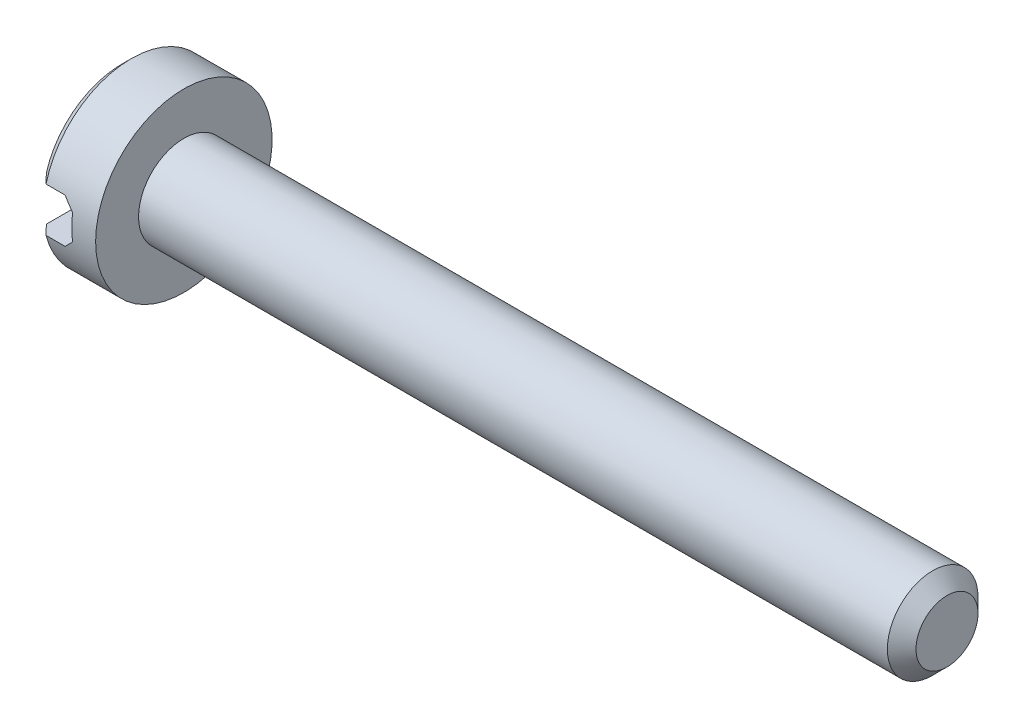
ISO-10303-21;
HEADER;
FILE_DESCRIPTION(('STEP AP214'),'2;1');
FILE_NAME('part.step','',(''),(''),'','','');
FILE_SCHEMA(('AUTOMOTIVE_DESIGN { 1 0 10303 214 1 1 1 1 }'));
ENDSEC;
DATA;
#1=APPLICATION_CONTEXT('core data for automotive mechanical design processes');
#2=APPLICATION_PROTOCOL_DEFINITION('international standard','automotive_design',2000,#1);
#3=PRODUCT_CONTEXT('',#1,'mechanical');
#4=PRODUCT('Part','Part','',(#3));
#5=PRODUCT_RELATED_PRODUCT_CATEGORY('part','',(#4));
#6=PRODUCT_DEFINITION_FORMATION('','',#4);
#7=PRODUCT_DEFINITION_CONTEXT('part definition',#1,'design');
#8=PRODUCT_DEFINITION('design','',#6,#7);
#9=PRODUCT_DEFINITION_SHAPE('','',#8);
#10=(LENGTH_UNIT() NAMED_UNIT(*) SI_UNIT(.MILLI.,.METRE.));
#11=(NAMED_UNIT(*) PLANE_ANGLE_UNIT() SI_UNIT($,.RADIAN.));
#12=(NAMED_UNIT(*) SI_UNIT($,.STERADIAN.) SOLID_ANGLE_UNIT());
#13=UNCERTAINTY_MEASURE_WITH_UNIT(LENGTH_MEASURE(1.E-05),#10,'distance_accuracy_value','');
#14=(GEOMETRIC_REPRESENTATION_CONTEXT(3) GLOBAL_UNCERTAINTY_ASSIGNED_CONTEXT((#13)) GLOBAL_UNIT_ASSIGNED_CONTEXT((#10,
#11,#12)) REPRESENTATION_CONTEXT('',''));
#15=CARTESIAN_POINT('',(0.,0.,0.));
#16=DIRECTION('',(0.,0.,1.));
#17=DIRECTION('',(1.,0.,0.));
#18=AXIS2_PLACEMENT_3D('',#15,#16,#17);
#19=CARTESIAN_POINT('',(1.3,1.85,0.));
#20=DIRECTION('',(-1.,0.,0.));
#21=DIRECTION('',(0.,0.,1.));
#22=AXIS2_PLACEMENT_3D('',#19,#20,#21);
#23=PLANE('',#22);
#24=CARTESIAN_POINT('',(1.3,0.,0.));
#25=DIRECTION('',(-1.,0.,0.));
#26=DIRECTION('',(0.,0.,1.));
#27=AXIS2_PLACEMENT_3D('',#24,#25,#26);
#28=CIRCLE('',#27,1.85);
#29=CARTESIAN_POINT('',(1.3,0.,1.85));
#30=VERTEX_POINT('',#29);
#31=EDGE_CURVE('E111',#30,#30,#28,.T.);
#32=ORIENTED_EDGE('',*,*,#31,.F.);
#33=EDGE_LOOP('',(#32));
#34=FACE_BOUND('',#33,.T.);
#35=CARTESIAN_POINT('',(1.3,0.,0.));
#36=DIRECTION('',(-1.,0.,0.));
#37=DIRECTION('',(0.,0.,1.));
#38=AXIS2_PLACEMENT_3D('',#35,#36,#37);
#39=CIRCLE('',#38,0.95);
#40=CARTESIAN_POINT('',(1.3,0.,0.95));
#41=VERTEX_POINT('',#40);
#42=EDGE_CURVE('E150',#41,#41,#39,.F.);
#43=ORIENTED_EDGE('',*,*,#42,.F.);
#44=EDGE_LOOP('',(#43));
#45=FACE_BOUND('',#44,.T.);
#46=ADVANCED_FACE('F37',(#34,#45),#23,.F.);
#47=CARTESIAN_POINT('',(0.2,0.,0.));
#48=DIRECTION('',(1.,0.,0.));
#49=DIRECTION('',(0.,0.,-1.));
#50=AXIS2_PLACEMENT_3D('',#47,#48,#49);
#51=CONICAL_SURFACE('',#50,1.85,0.785398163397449);
#52=CARTESIAN_POINT('',(0.2,0.,0.));
#53=DIRECTION('',(-1.,0.,0.));
#54=DIRECTION('',(0.,0.,1.));
#55=AXIS2_PLACEMENT_3D('',#52,#53,#54);
#56=CIRCLE('',#55,1.85);
#57=CARTESIAN_POINT('',(0.2,0.465549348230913,1.79046468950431));
#58=VERTEX_POINT('',#57);
#59=CARTESIAN_POINT('',(0.2,0.465549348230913,-1.79046468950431));
#60=VERTEX_POINT('',#59);
#61=EDGE_CURVE('E132',#58,#60,#56,.T.);
#62=ORIENTED_EDGE('',*,*,#61,.T.);
#63=CARTESIAN_POINT('',(2.42344087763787,0.465549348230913,-4.04674985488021));
#64=CARTESIAN_POINT('',(2.31422073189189,0.465549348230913,-3.9368070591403));
#65=CARTESIAN_POINT('',(2.20502763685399,0.465549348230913,-3.82683737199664));
#66=CARTESIAN_POINT('',(1.98669704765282,0.465549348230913,-3.60680197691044));
#67=CARTESIAN_POINT('',(1.87755956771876,0.465549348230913,-3.49673625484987));
#68=CARTESIAN_POINT('',(1.65894933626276,0.465549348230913,-3.27607034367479));
#69=CARTESIAN_POINT('',(1.54947697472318,0.465549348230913,-3.16546976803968));
#70=CARTESIAN_POINT('',(1.33068893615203,0.465549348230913,-2.94415427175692));
#71=CARTESIAN_POINT('',(1.22137323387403,0.465549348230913,-2.83343937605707));
#72=CARTESIAN_POINT('',(0.94158553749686,0.465549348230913,-2.54959909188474));
#73=CARTESIAN_POINT('',(0.771245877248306,0.465549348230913,-2.37634297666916));
#74=CARTESIAN_POINT('',(0.516315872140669,0.465549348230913,-2.11577452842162));
#75=CARTESIAN_POINT('',(0.431406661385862,0.465549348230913,-2.02877427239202));
#76=CARTESIAN_POINT('',(0.261908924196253,0.465549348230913,-1.85447495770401));
#77=CARTESIAN_POINT('',(0.177320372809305,0.465549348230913,-1.76717592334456));
#78=CARTESIAN_POINT('',(0.00893926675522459,0.465549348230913,-1.59244630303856));
#79=CARTESIAN_POINT('',(-0.0748550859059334,0.465549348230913,-1.50501745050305));
#80=CARTESIAN_POINT('',(-0.241707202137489,0.465549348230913,-1.32940591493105));
#81=CARTESIAN_POINT('',(-0.324764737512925,0.465549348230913,-1.24122301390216));
#82=CARTESIAN_POINT('',(-0.448249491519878,0.465549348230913,-1.10803308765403));
#83=CARTESIAN_POINT('',(-0.4892012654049,0.465549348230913,-1.06351303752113));
#84=CARTESIAN_POINT('',(-0.570603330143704,0.465549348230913,-0.974017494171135));
#85=CARTESIAN_POINT('',(-0.61105363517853,0.465549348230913,-0.929042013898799));
#86=CARTESIAN_POINT('',(-0.691196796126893,0.465549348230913,-0.838458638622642));
#87=CARTESIAN_POINT('',(-0.730890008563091,0.465549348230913,-0.792851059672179));
#88=CARTESIAN_POINT('',(-0.809128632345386,0.465549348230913,-0.700664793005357));
#89=CARTESIAN_POINT('',(-0.847674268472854,0.465549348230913,-0.654086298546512));
#90=CARTESIAN_POINT('',(-0.899367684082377,0.465549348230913,-0.588920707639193));
#91=CARTESIAN_POINT('',(-0.913355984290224,0.465549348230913,-0.571002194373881));
#92=CARTESIAN_POINT('',(-0.940978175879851,0.465549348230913,-0.53489334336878));
#93=CARTESIAN_POINT('',(-0.954612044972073,0.465549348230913,-0.516702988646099));
#94=CARTESIAN_POINT('',(-0.994922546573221,0.465549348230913,-0.461548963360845));
#95=CARTESIAN_POINT('',(-1.02093788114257,0.465549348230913,-0.424089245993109));
#96=CARTESIAN_POINT('',(-1.06919063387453,0.465549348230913,-0.348468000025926));
#97=CARTESIAN_POINT('',(-1.09152270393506,0.465549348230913,-0.310367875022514));
#98=CARTESIAN_POINT('',(-1.13109948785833,0.465549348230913,-0.231663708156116));
#99=CARTESIAN_POINT('',(-1.1483700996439,0.465549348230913,-0.191073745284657));
#100=CARTESIAN_POINT('',(-1.16937161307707,0.465549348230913,-0.122137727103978));
#101=CARTESIAN_POINT('',(-1.17573754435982,0.465549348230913,-0.0946292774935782));
#102=CARTESIAN_POINT('',(-1.18362415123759,0.465549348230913,-0.0389959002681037));
#103=CARTESIAN_POINT('',(-1.1851644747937,0.465549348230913,-0.0108739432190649));
#104=CARTESIAN_POINT('',(-1.18310496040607,0.465549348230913,0.0451823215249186));
#105=CARTESIAN_POINT('',(-1.17950248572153,0.465549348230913,0.0731165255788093));
#106=CARTESIAN_POINT('',(-1.16789735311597,0.465549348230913,0.128135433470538));
#107=CARTESIAN_POINT('',(-1.15987428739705,0.465549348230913,0.155215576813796));
#108=CARTESIAN_POINT('',(-1.13863829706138,0.465549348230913,0.213647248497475));
#109=CARTESIAN_POINT('',(-1.12469509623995,0.465549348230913,0.244723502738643));
#110=CARTESIAN_POINT('',(-1.09383840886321,0.465549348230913,0.305390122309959));
#111=CARTESIAN_POINT('',(-1.07691840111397,0.465549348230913,0.334977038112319));
#112=CARTESIAN_POINT('',(-1.04106417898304,0.465549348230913,0.393185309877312));
#113=CARTESIAN_POINT('',(-1.02211606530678,0.465549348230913,0.421797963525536));
#114=CARTESIAN_POINT('',(-0.982981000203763,0.465549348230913,0.478106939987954));
#115=CARTESIAN_POINT('',(-0.962795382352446,0.465549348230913,0.505804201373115));
#116=CARTESIAN_POINT('',(-0.919274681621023,0.465549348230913,0.563580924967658));
#117=CARTESIAN_POINT('',(-0.895838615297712,0.465549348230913,0.593583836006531));
#118=CARTESIAN_POINT('',(-0.848230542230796,0.465549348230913,0.65300190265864));
#119=CARTESIAN_POINT('',(-0.82405844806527,0.465549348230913,0.682416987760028));
#120=CARTESIAN_POINT('',(-0.750747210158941,0.465549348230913,0.770035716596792));
#121=CARTESIAN_POINT('',(-0.700832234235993,0.465549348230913,0.827588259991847));
#122=CARTESIAN_POINT('',(-0.599780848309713,0.465549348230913,0.941762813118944));
#123=CARTESIAN_POINT('',(-0.548642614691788,0.465549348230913,0.998383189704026));
#124=CARTESIAN_POINT('',(-0.445660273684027,0.465549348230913,1.11095186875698));
#125=CARTESIAN_POINT('',(-0.393816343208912,0.465549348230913,1.16690033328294));
#126=CARTESIAN_POINT('',(-0.289869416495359,0.465549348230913,1.27812634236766));
#127=CARTESIAN_POINT('',(-0.237768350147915,0.465549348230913,1.33340569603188));
#128=CARTESIAN_POINT('',(-0.133235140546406,0.465549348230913,1.44365673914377));
#129=CARTESIAN_POINT('',(-0.0808029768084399,0.465549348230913,1.49862840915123));
#130=CARTESIAN_POINT('',(0.0767523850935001,0.465549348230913,1.66311055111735));
#131=CARTESIAN_POINT('',(0.182225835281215,0.465549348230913,1.77228519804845));
#132=CARTESIAN_POINT('',(0.46430719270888,0.465549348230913,2.06287985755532));
#133=CARTESIAN_POINT('',(0.641375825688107,0.465549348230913,2.24385154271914));
#134=CARTESIAN_POINT('',(0.996250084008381,0.465549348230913,2.60519009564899));
#135=CARTESIAN_POINT('',(1.17405593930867,0.465549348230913,2.7855567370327));
#136=CARTESIAN_POINT('',(1.53035733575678,0.465549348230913,3.14622495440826));
#137=CARTESIAN_POINT('',(1.70885353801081,0.465549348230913,3.32652587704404));
#138=CARTESIAN_POINT('',(2.06602855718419,0.465549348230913,3.68681939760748));
#139=CARTESIAN_POINT('',(2.24470728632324,0.465549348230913,3.86681208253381));
#140=CARTESIAN_POINT('',(2.42344087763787,0.465549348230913,4.04674985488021));
#141=B_SPLINE_CURVE_WITH_KNOTS('',3,(#63,#64,#65,#66,#67,#68,#69,#70,#71,#72,#73,#74,#75,#76,
#77,#78,#79,#80,#81,#82,#83,#84,#85,#86,#87,#88,#89,#90,#91,#92,#93,#94,#95,#96,#97,#98,#99,
#100,#101,#102,#103,#104,#105,#106,#107,#108,#109,#110,#111,#112,#113,#114,#115,#116,#117,#118,
#119,#120,#121,#122,#123,#124,#125,#126,#127,#128,#129,#130,#131,#132,#133,#134,#135,#136,#137,
#138,#139,#140),.UNSPECIFIED.,.F.,.F.,(4,2,2,2,2,2,2,2,2,2,2,2,2,2,2,2,2,2,2,2,2,2,2,2,2,2,2,2,
2,2,2,2,2,2,2,2,2,2,4),(0.,0.46491734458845,0.929921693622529,1.39677290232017,1.86353771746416,
2.59243863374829,2.95714021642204,3.32181281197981,3.68511212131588,4.04852027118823,
4.22998896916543,4.41145252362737,4.59282840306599,4.77416851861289,4.84236041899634,
4.91055659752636,5.04728388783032,5.17961007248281,5.31124686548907,5.39561130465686,
5.47963179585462,5.56369538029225,5.64815033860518,5.75007643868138,5.85222867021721,
5.95513223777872,6.05792679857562,6.17212384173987,6.28633450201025,6.51484917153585,
6.74372884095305,6.97255215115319,7.20043854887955,7.42833918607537,7.88374058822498,
8.64329990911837,9.40311729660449,10.1642502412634,10.9251118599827),.UNSPECIFIED.);
#142=CARTESIAN_POINT('',(0.,0.465549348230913,-1.58296045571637));
#143=VERTEX_POINT('',#142);
#144=EDGE_CURVE('E128',#60,#143,#141,.T.);
#145=ORIENTED_EDGE('',*,*,#144,.T.);
#146=CARTESIAN_POINT('',(0.,0.,0.));
#147=DIRECTION('',(-1.,0.,0.));
#148=DIRECTION('',(0.,0.,1.));
#149=AXIS2_PLACEMENT_3D('',#146,#147,#148);
#150=CIRCLE('',#149,1.65);
#151=CARTESIAN_POINT('',(0.,0.465549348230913,1.58296045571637));
#152=VERTEX_POINT('',#151);
#153=EDGE_CURVE('E123',#152,#143,#150,.T.);
#154=ORIENTED_EDGE('',*,*,#153,.F.);
#155=EDGE_CURVE('E191',#152,#58,#141,.T.);
#156=ORIENTED_EDGE('',*,*,#155,.T.);
#157=EDGE_LOOP('',(#62,#145,#154,#156));
#158=FACE_BOUND('',#157,.T.);
#159=ADVANCED_FACE('F166',(#158),#51,.T.);
#160=CARTESIAN_POINT('',(0.,0.,0.));
#161=DIRECTION('',(1.,0.,0.));
#162=DIRECTION('',(0.,0.,-1.));
#163=AXIS2_PLACEMENT_3D('',#160,#161,#162);
#164=PLANE('',#163);
#165=ORIENTED_EDGE('',*,*,#153,.T.);
#166=DIRECTION('',(0.,0.,1.));
#167=VECTOR('',#166,1.);
#168=CARTESIAN_POINT('',(0.,0.465549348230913,0.));
#169=LINE('',#168,#167);
#170=EDGE_CURVE('E110',#143,#152,#169,.T.);
#171=ORIENTED_EDGE('',*,*,#170,.T.);
#172=EDGE_LOOP('',(#165,#171));
#173=FACE_BOUND('',#172,.T.);
#174=ADVANCED_FACE('F171',(#173),#164,.F.);
#175=CARTESIAN_POINT('',(0.,0.,0.));
#176=DIRECTION('',(-1.,0.,0.));
#177=DIRECTION('',(0.,0.,1.));
#178=AXIS2_PLACEMENT_3D('',#175,#176,#177);
#179=CYLINDRICAL_SURFACE('',#178,1.85);
#180=ORIENTED_EDGE('',*,*,#61,.F.);
#181=DIRECTION('',(-1.,0.,0.));
#182=VECTOR('',#181,1.);
#183=CARTESIAN_POINT('',(0.,0.465549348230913,1.79046468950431));
#184=LINE('',#183,#182);
#185=CARTESIAN_POINT('',(0.6,0.465549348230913,1.79046468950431));
#186=VERTEX_POINT('',#185);
#187=EDGE_CURVE('E198',#58,#186,#184,.F.);
#188=ORIENTED_EDGE('',*,*,#187,.T.);
#189=CARTESIAN_POINT('',(1.06554934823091,0.,0.));
#190=DIRECTION('',(0.707106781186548,0.707106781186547,0.));
#191=DIRECTION('',(-0.707106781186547,0.707106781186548,0.));
#192=AXIS2_PLACEMENT_3D('',#189,#190,#191);
#193=ELLIPSE('',#192,2.61629509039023,1.85);
#194=CARTESIAN_POINT('',(0.8,0.265549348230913,1.83084230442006));
#195=VERTEX_POINT('',#194);
#196=EDGE_CURVE('E149',#186,#195,#193,.T.);
#197=ORIENTED_EDGE('',*,*,#196,.T.);
#198=CARTESIAN_POINT('',(0.8,0.,0.));
#199=DIRECTION('',(1.,0.,0.));
#200=DIRECTION('',(0.,0.,-1.));
#201=AXIS2_PLACEMENT_3D('',#198,#199,#200);
#202=CIRCLE('',#201,1.85);
#203=CARTESIAN_POINT('',(0.8,-0.265549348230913,1.83084230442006));
#204=VERTEX_POINT('',#203);
#205=EDGE_CURVE('E60',#195,#204,#202,.T.);
#206=ORIENTED_EDGE('',*,*,#205,.T.);
#207=CARTESIAN_POINT('',(1.06554934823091,0.,0.));
#208=DIRECTION('',(0.707106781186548,-0.707106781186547,0.));
#209=DIRECTION('',(-0.707106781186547,-0.707106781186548,0.));
#210=AXIS2_PLACEMENT_3D('',#207,#208,#209);
#211=ELLIPSE('',#210,2.61629509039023,1.85);
#212=CARTESIAN_POINT('',(0.6,-0.465549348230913,1.79046468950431));
#213=VERTEX_POINT('',#212);
#214=EDGE_CURVE('E143',#204,#213,#211,.T.);
#215=ORIENTED_EDGE('',*,*,#214,.T.);
#216=DIRECTION('',(-1.,0.,0.));
#217=VECTOR('',#216,1.);
#218=CARTESIAN_POINT('',(0.,-0.465549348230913,1.79046468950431));
#219=LINE('',#218,#217);
#220=CARTESIAN_POINT('',(0.2,-0.465549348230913,1.79046468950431));
#221=VERTEX_POINT('',#220);
#222=EDGE_CURVE('E119',#213,#221,#219,.T.);
#223=ORIENTED_EDGE('',*,*,#222,.T.);
#224=CARTESIAN_POINT('',(0.2,-0.465549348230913,-1.79046468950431));
#225=VERTEX_POINT('',#224);
#226=EDGE_CURVE('E118',#225,#221,#56,.T.);
#227=ORIENTED_EDGE('',*,*,#226,.F.);
#228=DIRECTION('',(-1.,0.,0.));
#229=VECTOR('',#228,1.);
#230=CARTESIAN_POINT('',(0.,-0.465549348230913,-1.79046468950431));
#231=LINE('',#230,#229);
#232=CARTESIAN_POINT('',(0.6,-0.465549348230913,-1.79046468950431));
#233=VERTEX_POINT('',#232);
#234=EDGE_CURVE('E120',#225,#233,#231,.F.);
#235=ORIENTED_EDGE('',*,*,#234,.T.);
#236=CARTESIAN_POINT('',(0.8,-0.265549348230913,-1.83084230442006));
#237=VERTEX_POINT('',#236);
#238=EDGE_CURVE('E139',#233,#237,#211,.T.);
#239=ORIENTED_EDGE('',*,*,#238,.T.);
#240=CARTESIAN_POINT('',(0.8,0.265549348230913,-1.83084230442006));
#241=VERTEX_POINT('',#240);
#242=EDGE_CURVE('E142',#237,#241,#202,.T.);
#243=ORIENTED_EDGE('',*,*,#242,.T.);
#244=CARTESIAN_POINT('',(0.6,0.465549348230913,-1.79046468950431));
#245=VERTEX_POINT('',#244);
#246=EDGE_CURVE('E146',#241,#245,#193,.T.);
#247=ORIENTED_EDGE('',*,*,#246,.T.);
#248=DIRECTION('',(-1.,0.,0.));
#249=VECTOR('',#248,1.);
#250=CARTESIAN_POINT('',(0.,0.465549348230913,-1.79046468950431));
#251=LINE('',#250,#249);
#252=EDGE_CURVE('E124',#245,#60,#251,.T.);
#253=ORIENTED_EDGE('',*,*,#252,.T.);
#254=EDGE_LOOP('',(#180,#188,#197,#206,#215,#223,#227,#235,#239,#243,#247,#253));
#255=FACE_BOUND('',#254,.T.);
#256=ORIENTED_EDGE('',*,*,#31,.T.);
#257=EDGE_LOOP('',(#256));
#258=FACE_BOUND('',#257,.T.);
#259=ADVANCED_FACE('F177',(#255,#258),#179,.T.);
#260=ORIENTED_EDGE('',*,*,#226,.T.);
#261=CARTESIAN_POINT('',(2.42344087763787,-0.465549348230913,4.0467498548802));
#262=CARTESIAN_POINT('',(2.31422073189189,-0.465549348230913,3.9368070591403));
#263=CARTESIAN_POINT('',(2.20502763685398,-0.465549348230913,3.82683737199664));
#264=CARTESIAN_POINT('',(1.98669704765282,-0.465549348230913,3.60680197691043));
#265=CARTESIAN_POINT('',(1.87755956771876,-0.465549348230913,3.49673625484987));
#266=CARTESIAN_POINT('',(1.65894933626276,-0.465549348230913,3.27607034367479));
#267=CARTESIAN_POINT('',(1.54947697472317,-0.465549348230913,3.16546976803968));
#268=CARTESIAN_POINT('',(1.33068893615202,-0.465549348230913,2.94415427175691));
#269=CARTESIAN_POINT('',(1.22137323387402,-0.465549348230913,2.83343937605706));
#270=CARTESIAN_POINT('',(0.941585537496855,-0.465549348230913,2.54959909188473));
#271=CARTESIAN_POINT('',(0.771245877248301,-0.465549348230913,2.37634297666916));
#272=CARTESIAN_POINT('',(0.516315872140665,-0.465549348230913,2.11577452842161));
#273=CARTESIAN_POINT('',(0.431406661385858,-0.465549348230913,2.02877427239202));
#274=CARTESIAN_POINT('',(0.261908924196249,-0.465549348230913,1.85447495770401));
#275=CARTESIAN_POINT('',(0.177320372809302,-0.465549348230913,1.76717592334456));
#276=CARTESIAN_POINT('',(0.00893926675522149,-0.465549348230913,1.59244630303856));
#277=CARTESIAN_POINT('',(-0.0748550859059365,-0.465549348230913,1.50501745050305));
#278=CARTESIAN_POINT('',(-0.241707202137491,-0.465549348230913,1.32940591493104));
#279=CARTESIAN_POINT('',(-0.324764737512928,-0.465549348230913,1.24122301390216));
#280=CARTESIAN_POINT('',(-0.44824949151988,-0.465549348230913,1.10803308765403));
#281=CARTESIAN_POINT('',(-0.489201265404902,-0.465549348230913,1.06351303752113));
#282=CARTESIAN_POINT('',(-0.570603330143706,-0.465549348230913,0.974017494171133));
#283=CARTESIAN_POINT('',(-0.611053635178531,-0.465549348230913,0.929042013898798));
#284=CARTESIAN_POINT('',(-0.691196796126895,-0.465549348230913,0.83845863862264));
#285=CARTESIAN_POINT('',(-0.730890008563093,-0.465549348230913,0.792851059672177));
#286=CARTESIAN_POINT('',(-0.809128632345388,-0.465549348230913,0.700664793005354));
#287=CARTESIAN_POINT('',(-0.847674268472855,-0.465549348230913,0.65408629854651));
#288=CARTESIAN_POINT('',(-0.899367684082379,-0.465549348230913,0.588920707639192));
#289=CARTESIAN_POINT('',(-0.913355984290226,-0.465549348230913,0.571002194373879));
#290=CARTESIAN_POINT('',(-0.940978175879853,-0.465549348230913,0.534893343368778));
#291=CARTESIAN_POINT('',(-0.954612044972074,-0.465549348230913,0.516702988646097));
#292=CARTESIAN_POINT('',(-0.994922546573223,-0.465549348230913,0.461548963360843));
#293=CARTESIAN_POINT('',(-1.02093788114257,-0.465549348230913,0.424089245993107));
#294=CARTESIAN_POINT('',(-1.06919063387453,-0.465549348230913,0.348468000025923));
#295=CARTESIAN_POINT('',(-1.09152270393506,-0.465549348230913,0.310367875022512));
#296=CARTESIAN_POINT('',(-1.13109948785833,-0.465549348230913,0.231663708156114));
#297=CARTESIAN_POINT('',(-1.1483700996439,-0.465549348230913,0.191073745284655));
#298=CARTESIAN_POINT('',(-1.16937161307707,-0.465549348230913,0.122137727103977));
#299=CARTESIAN_POINT('',(-1.17573754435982,-0.465549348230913,0.0946292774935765));
#300=CARTESIAN_POINT('',(-1.18362415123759,-0.465549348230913,0.0389959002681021));
#301=CARTESIAN_POINT('',(-1.1851644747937,-0.465549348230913,0.0108739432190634));
#302=CARTESIAN_POINT('',(-1.18310496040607,-0.465549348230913,-0.0451823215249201));
#303=CARTESIAN_POINT('',(-1.17950248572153,-0.465549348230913,-0.0731165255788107));
#304=CARTESIAN_POINT('',(-1.16789735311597,-0.465549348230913,-0.128135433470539));
#305=CARTESIAN_POINT('',(-1.15987428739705,-0.465549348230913,-0.155215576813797));
#306=CARTESIAN_POINT('',(-1.13863829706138,-0.465549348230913,-0.213647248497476));
#307=CARTESIAN_POINT('',(-1.12469509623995,-0.465549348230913,-0.244723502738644));
#308=CARTESIAN_POINT('',(-1.09383840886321,-0.465549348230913,-0.305390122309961));
#309=CARTESIAN_POINT('',(-1.07691840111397,-0.465549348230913,-0.334977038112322));
#310=CARTESIAN_POINT('',(-1.04106417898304,-0.465549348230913,-0.393185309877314));
#311=CARTESIAN_POINT('',(-1.02211606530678,-0.465549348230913,-0.421797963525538));
#312=CARTESIAN_POINT('',(-0.982981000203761,-0.465549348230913,-0.478106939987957));
#313=CARTESIAN_POINT('',(-0.962795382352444,-0.465549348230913,-0.505804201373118));
#314=CARTESIAN_POINT('',(-0.919274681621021,-0.465549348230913,-0.563580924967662));
#315=CARTESIAN_POINT('',(-0.895838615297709,-0.465549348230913,-0.593583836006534));
#316=CARTESIAN_POINT('',(-0.848230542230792,-0.465549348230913,-0.653001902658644));
#317=CARTESIAN_POINT('',(-0.824058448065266,-0.465549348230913,-0.682416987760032));
#318=CARTESIAN_POINT('',(-0.750747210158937,-0.465549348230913,-0.770035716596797));
#319=CARTESIAN_POINT('',(-0.700832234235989,-0.465549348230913,-0.827588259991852));
#320=CARTESIAN_POINT('',(-0.599780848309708,-0.465549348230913,-0.941762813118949));
#321=CARTESIAN_POINT('',(-0.548642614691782,-0.465549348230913,-0.998383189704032));
#322=CARTESIAN_POINT('',(-0.44566027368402,-0.465549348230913,-1.11095186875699));
#323=CARTESIAN_POINT('',(-0.393816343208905,-0.465549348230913,-1.16690033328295));
#324=CARTESIAN_POINT('',(-0.289869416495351,-0.465549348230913,-1.27812634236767));
#325=CARTESIAN_POINT('',(-0.237768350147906,-0.465549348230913,-1.33340569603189));
#326=CARTESIAN_POINT('',(-0.133235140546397,-0.465549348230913,-1.44365673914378));
#327=CARTESIAN_POINT('',(-0.0808029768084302,-0.465549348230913,-1.49862840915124));
#328=CARTESIAN_POINT('',(0.0767523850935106,-0.465549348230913,-1.66311055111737));
#329=CARTESIAN_POINT('',(0.182225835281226,-0.465549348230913,-1.77228519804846));
#330=CARTESIAN_POINT('',(0.464307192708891,-0.465549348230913,-2.06287985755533));
#331=CARTESIAN_POINT('',(0.641375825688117,-0.465549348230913,-2.24385154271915));
#332=CARTESIAN_POINT('',(0.996250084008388,-0.465549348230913,-2.605190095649));
#333=CARTESIAN_POINT('',(1.17405593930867,-0.465549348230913,-2.7855567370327));
#334=CARTESIAN_POINT('',(1.53035733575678,-0.465549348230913,-3.14622495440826));
#335=CARTESIAN_POINT('',(1.70885353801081,-0.465549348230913,-3.32652587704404));
#336=CARTESIAN_POINT('',(2.06602855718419,-0.465549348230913,-3.68681939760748));
#337=CARTESIAN_POINT('',(2.24470728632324,-0.465549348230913,-3.86681208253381));
#338=CARTESIAN_POINT('',(2.42344087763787,-0.465549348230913,-4.0467498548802));
#339=B_SPLINE_CURVE_WITH_KNOTS('',3,(#261,#262,#263,#264,#265,#266,#267,#268,#269,#270,#271,
#272,#273,#274,#275,#276,#277,#278,#279,#280,#281,#282,#283,#284,#285,#286,#287,#288,#289,#290,
#291,#292,#293,#294,#295,#296,#297,#298,#299,#300,#301,#302,#303,#304,#305,#306,#307,#308,#309,
#310,#311,#312,#313,#314,#315,#316,#317,#318,#319,#320,#321,#322,#323,#324,#325,#326,#327,#328,
#329,#330,#331,#332,#333,#334,#335,#336,#337,#338),.UNSPECIFIED.,.F.,.F.,(4,2,2,2,2,2,2,2,2,2,2,
2,2,2,2,2,2,2,2,2,2,2,2,2,2,2,2,2,2,2,2,2,2,2,2,2,2,2,4),(0.,0.46491734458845,0.929921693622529,
1.39677290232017,1.86353771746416,2.59243863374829,2.95714021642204,3.32181281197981,
3.68511212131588,4.04852027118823,4.22998896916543,4.41145252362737,4.59282840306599,
4.77416851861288,4.84236041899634,4.91055659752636,5.04728388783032,5.1796100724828,
5.31124686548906,5.39561130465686,5.47963179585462,5.56369538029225,5.64815033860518,
5.75007643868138,5.85222867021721,5.95513223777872,6.05792679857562,6.17212384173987,
6.28633450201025,6.51484917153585,6.74372884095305,6.97255215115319,7.20043854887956,
7.42833918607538,7.883740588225,8.64329990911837,9.40311729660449,10.1642502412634,
10.9251118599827),.UNSPECIFIED.);
#340=CARTESIAN_POINT('',(0.,-0.465549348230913,1.58296045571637));
#341=VERTEX_POINT('',#340);
#342=EDGE_CURVE('E105',#221,#341,#339,.T.);
#343=ORIENTED_EDGE('',*,*,#342,.T.);
#344=CARTESIAN_POINT('',(0.,-0.465549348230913,-1.58296045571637));
#345=VERTEX_POINT('',#344);
#346=EDGE_CURVE('E116',#345,#341,#150,.T.);
#347=ORIENTED_EDGE('',*,*,#346,.F.);
#348=EDGE_CURVE('E52',#345,#225,#339,.T.);
#349=ORIENTED_EDGE('',*,*,#348,.T.);
#350=EDGE_LOOP('',(#260,#343,#347,#349));
#351=FACE_BOUND('',#350,.T.);
#352=ADVANCED_FACE('F115',(#351),#51,.T.);
#353=ORIENTED_EDGE('',*,*,#346,.T.);
#354=DIRECTION('',(0.,0.,-1.));
#355=VECTOR('',#354,1.);
#356=CARTESIAN_POINT('',(0.,-0.465549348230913,0.));
#357=LINE('',#356,#355);
#358=EDGE_CURVE('E101',#341,#345,#357,.T.);
#359=ORIENTED_EDGE('',*,*,#358,.T.);
#360=EDGE_LOOP('',(#353,#359));
#361=FACE_BOUND('',#360,.T.);
#362=ADVANCED_FACE('F122',(#361),#164,.F.);
#363=CARTESIAN_POINT('',(0.6,0.465549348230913,-5.));
#364=DIRECTION('',(0.707106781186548,0.707106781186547,0.));
#365=DIRECTION('',(-0.707106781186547,0.707106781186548,0.));
#366=AXIS2_PLACEMENT_3D('',#363,#364,#365);
#367=PLANE('',#366);
#368=DIRECTION('',(0.,0.,1.));
#369=VECTOR('',#368,1.);
#370=CARTESIAN_POINT('',(0.6,0.465549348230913,-5.));
#371=LINE('',#370,#369);
#372=EDGE_CURVE('E312',#245,#186,#371,.T.);
#373=ORIENTED_EDGE('',*,*,#372,.F.);
#374=ORIENTED_EDGE('',*,*,#246,.F.);
#375=DIRECTION('',(0.,0.,1.));
#376=VECTOR('',#375,1.);
#377=CARTESIAN_POINT('',(0.8,0.265549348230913,-5.));
#378=LINE('',#377,#376);
#379=EDGE_CURVE('E313',#241,#195,#378,.T.);
#380=ORIENTED_EDGE('',*,*,#379,.T.);
#381=ORIENTED_EDGE('',*,*,#196,.F.);
#382=EDGE_LOOP('',(#373,#374,#380,#381));
#383=FACE_BOUND('',#382,.T.);
#384=ADVANCED_FACE('F206',(#383),#367,.F.);
#385=CARTESIAN_POINT('',(0.8,0.265549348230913,-5.));
#386=DIRECTION('',(1.,0.,0.));
#387=DIRECTION('',(0.,0.,-1.));
#388=AXIS2_PLACEMENT_3D('',#385,#386,#387);
#389=PLANE('',#388);
#390=ORIENTED_EDGE('',*,*,#379,.F.);
#391=ORIENTED_EDGE('',*,*,#242,.F.);
#392=DIRECTION('',(0.,0.,1.));
#393=VECTOR('',#392,1.);
#394=CARTESIAN_POINT('',(0.8,-0.265549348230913,-5.));
#395=LINE('',#394,#393);
#396=EDGE_CURVE('E315',#237,#204,#395,.T.);
#397=ORIENTED_EDGE('',*,*,#396,.T.);
#398=ORIENTED_EDGE('',*,*,#205,.F.);
#399=EDGE_LOOP('',(#390,#391,#397,#398));
#400=FACE_BOUND('',#399,.T.);
#401=ADVANCED_FACE('F209',(#400),#389,.F.);
#402=CARTESIAN_POINT('',(0.6,-0.465549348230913,-5.));
#403=DIRECTION('',(0.707106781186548,-0.707106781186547,0.));
#404=DIRECTION('',(0.707106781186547,0.707106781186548,0.));
#405=AXIS2_PLACEMENT_3D('',#402,#403,#404);
#406=PLANE('',#405);
#407=DIRECTION('',(0.,0.,1.));
#408=VECTOR('',#407,1.);
#409=CARTESIAN_POINT('',(0.6,-0.465549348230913,-5.));
#410=LINE('',#409,#408);
#411=EDGE_CURVE('E318',#233,#213,#410,.T.);
#412=ORIENTED_EDGE('',*,*,#411,.T.);
#413=ORIENTED_EDGE('',*,*,#214,.F.);
#414=ORIENTED_EDGE('',*,*,#396,.F.);
#415=ORIENTED_EDGE('',*,*,#238,.F.);
#416=EDGE_LOOP('',(#412,#413,#414,#415));
#417=FACE_BOUND('',#416,.T.);
#418=ADVANCED_FACE('F204',(#417),#406,.F.);
#419=CARTESIAN_POINT('',(0.,0.465549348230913,-5.));
#420=DIRECTION('',(0.,1.,0.));
#421=DIRECTION('',(0.,0.,1.));
#422=AXIS2_PLACEMENT_3D('',#419,#420,#421);
#423=PLANE('',#422);
#424=ORIENTED_EDGE('',*,*,#372,.T.);
#425=ORIENTED_EDGE('',*,*,#187,.F.);
#426=ORIENTED_EDGE('',*,*,#155,.F.);
#427=ORIENTED_EDGE('',*,*,#170,.F.);
#428=ORIENTED_EDGE('',*,*,#144,.F.);
#429=ORIENTED_EDGE('',*,*,#252,.F.);
#430=EDGE_LOOP('',(#424,#425,#426,#427,#428,#429));
#431=FACE_BOUND('',#430,.T.);
#432=ADVANCED_FACE('F199',(#431),#423,.F.);
#433=CARTESIAN_POINT('',(0.,-0.465549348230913,-5.));
#434=DIRECTION('',(0.,-1.,0.));
#435=DIRECTION('',(0.,0.,-1.));
#436=AXIS2_PLACEMENT_3D('',#433,#434,#435);
#437=PLANE('',#436);
#438=ORIENTED_EDGE('',*,*,#411,.F.);
#439=ORIENTED_EDGE('',*,*,#234,.F.);
#440=ORIENTED_EDGE('',*,*,#348,.F.);
#441=ORIENTED_EDGE('',*,*,#358,.F.);
#442=ORIENTED_EDGE('',*,*,#342,.F.);
#443=ORIENTED_EDGE('',*,*,#222,.F.);
#444=EDGE_LOOP('',(#438,#439,#440,#441,#442,#443));
#445=FACE_BOUND('',#444,.T.);
#446=ADVANCED_FACE('F104',(#445),#437,.F.);
#447=CARTESIAN_POINT('',(17.3,0.,0.));
#448=DIRECTION('',(-1.,0.,0.));
#449=DIRECTION('',(0.,0.,1.));
#450=AXIS2_PLACEMENT_3D('',#447,#448,#449);
#451=CYLINDRICAL_SURFACE('',#450,0.95);
#452=CARTESIAN_POINT('',(17.,0.,0.));
#453=DIRECTION('',(1.,0.,0.));
#454=DIRECTION('',(0.,0.,-1.));
#455=AXIS2_PLACEMENT_3D('',#452,#453,#454);
#456=CIRCLE('',#455,0.95);
#457=CARTESIAN_POINT('',(17.,0.,-0.95));
#458=VERTEX_POINT('',#457);
#459=EDGE_CURVE('E11',#458,#458,#456,.F.);
#460=ORIENTED_EDGE('',*,*,#459,.T.);
#461=EDGE_LOOP('',(#460));
#462=FACE_BOUND('',#461,.T.);
#463=ORIENTED_EDGE('',*,*,#42,.T.);
#464=EDGE_LOOP('',(#463));
#465=FACE_BOUND('',#464,.T.);
#466=ADVANCED_FACE('F162',(#462,#465),#451,.T.);
#467=CARTESIAN_POINT('',(17.3,0.,0.));
#468=DIRECTION('',(1.,0.,0.));
#469=DIRECTION('',(0.,0.,-1.));
#470=AXIS2_PLACEMENT_3D('',#467,#468,#469);
#471=PLANE('',#470);
#472=CARTESIAN_POINT('',(17.3,0.,0.));
#473=DIRECTION('',(1.,0.,0.));
#474=DIRECTION('',(0.,0.,-1.));
#475=AXIS2_PLACEMENT_3D('',#472,#473,#474);
#476=CIRCLE('',#475,0.650000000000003);
#477=CARTESIAN_POINT('',(17.3,0.,-0.650000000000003));
#478=VERTEX_POINT('',#477);
#479=EDGE_CURVE('E45',#478,#478,#476,.T.);
#480=ORIENTED_EDGE('',*,*,#479,.T.);
#481=EDGE_LOOP('',(#480));
#482=FACE_BOUND('',#481,.T.);
#483=ADVANCED_FACE('F155',(#482),#471,.T.);
#484=CARTESIAN_POINT('',(17.3,0.,0.));
#485=DIRECTION('',(-1.,0.,0.));
#486=DIRECTION('',(0.,0.,1.));
#487=AXIS2_PLACEMENT_3D('',#484,#485,#486);
#488=CONICAL_SURFACE('',#487,0.650000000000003,0.785398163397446);
#489=ORIENTED_EDGE('',*,*,#459,.F.);
#490=EDGE_LOOP('',(#489));
#491=FACE_BOUND('',#490,.T.);
#492=ORIENTED_EDGE('',*,*,#479,.F.);
#493=EDGE_LOOP('',(#492));
#494=FACE_BOUND('',#493,.T.);
#495=ADVANCED_FACE('F39',(#491,#494),#488,.T.);
#496=CLOSED_SHELL('',(#46,#159,#174,#259,#352,#362,#384,#401,#418,#432,#446,#466,#483,#495));
#497=MANIFOLD_SOLID_BREP('B2',#496);
#498=ADVANCED_BREP_SHAPE_REPRESENTATION('',(#18,#497),#14);
#499=SHAPE_DEFINITION_REPRESENTATION(#9,#498);
ENDSEC;
END-ISO-10303-21;
